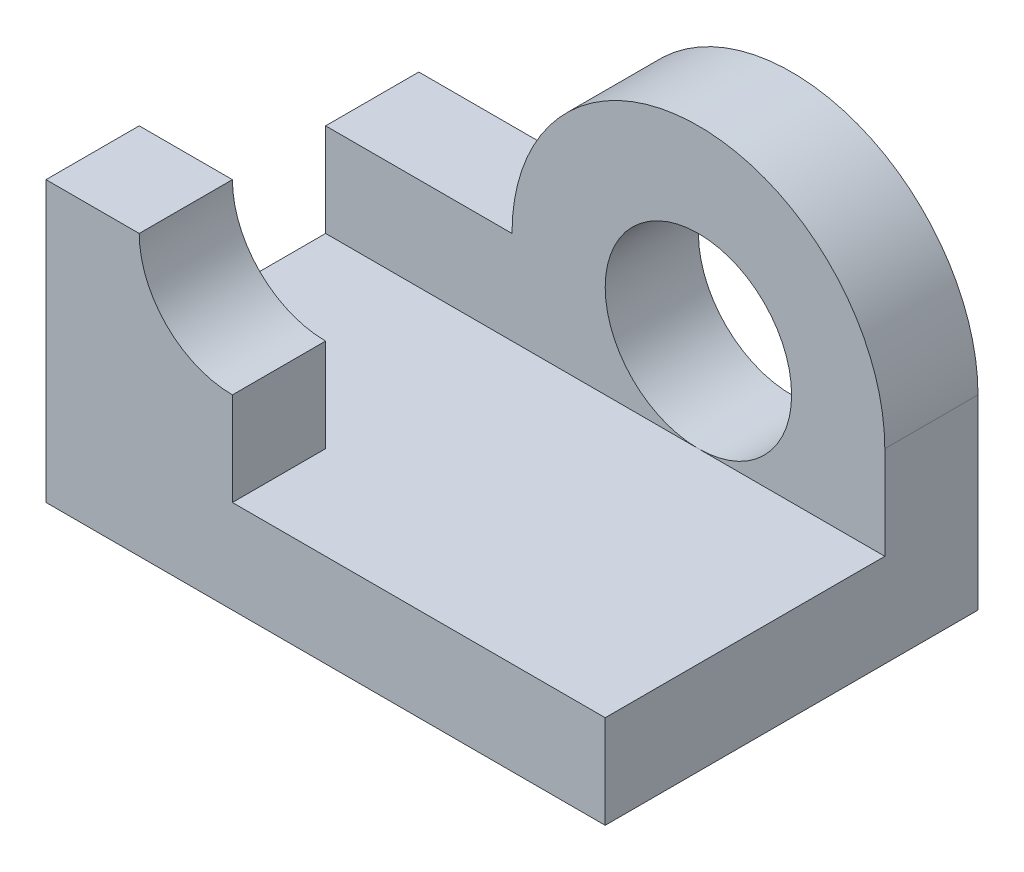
ISO-10303-21;
HEADER;
FILE_DESCRIPTION(('STEP AP214'),'2;1');
FILE_NAME('part.step','',(''),(''),'','','');
FILE_SCHEMA(('AUTOMOTIVE_DESIGN { 1 0 10303 214 1 1 1 1 }'));
ENDSEC;
DATA;
#1=APPLICATION_CONTEXT('core data for automotive mechanical design processes');
#2=APPLICATION_PROTOCOL_DEFINITION('international standard','automotive_design',2000,#1);
#3=PRODUCT_CONTEXT('',#1,'mechanical');
#4=PRODUCT('Part','Part','',(#3));
#5=PRODUCT_RELATED_PRODUCT_CATEGORY('part','',(#4));
#6=PRODUCT_DEFINITION_FORMATION('','',#4);
#7=PRODUCT_DEFINITION_CONTEXT('part definition',#1,'design');
#8=PRODUCT_DEFINITION('design','',#6,#7);
#9=PRODUCT_DEFINITION_SHAPE('','',#8);
#10=(LENGTH_UNIT() NAMED_UNIT(*) SI_UNIT(.MILLI.,.METRE.));
#11=(NAMED_UNIT(*) PLANE_ANGLE_UNIT() SI_UNIT($,.RADIAN.));
#12=(NAMED_UNIT(*) SI_UNIT($,.STERADIAN.) SOLID_ANGLE_UNIT());
#13=UNCERTAINTY_MEASURE_WITH_UNIT(LENGTH_MEASURE(1.E-05),#10,'distance_accuracy_value','');
#14=(GEOMETRIC_REPRESENTATION_CONTEXT(3) GLOBAL_UNCERTAINTY_ASSIGNED_CONTEXT((#13)) GLOBAL_UNIT_ASSIGNED_CONTEXT((#10,
#11,#12)) REPRESENTATION_CONTEXT('',''));
#15=CARTESIAN_POINT('',(0.,0.,0.));
#16=DIRECTION('',(0.,0.,1.));
#17=DIRECTION('',(1.,0.,0.));
#18=AXIS2_PLACEMENT_3D('',#15,#16,#17);
#19=CARTESIAN_POINT('',(0.,10.,-40.));
#20=DIRECTION('',(0.,-1.,0.));
#21=DIRECTION('',(0.,0.,-1.));
#22=AXIS2_PLACEMENT_3D('',#19,#20,#21);
#23=PLANE('',#22);
#24=DIRECTION('',(1.,0.,0.));
#25=VECTOR('',#24,1.);
#26=CARTESIAN_POINT('',(0.,10.,-30.));
#27=LINE('',#26,#25);
#28=CARTESIAN_POINT('',(0.,10.,-30.));
#29=VERTEX_POINT('',#28);
#30=CARTESIAN_POINT('',(40.,10.,-30.));
#31=VERTEX_POINT('',#30);
#32=EDGE_CURVE('E156',#29,#31,#27,.T.);
#33=ORIENTED_EDGE('',*,*,#32,.F.);
#34=DIRECTION('',(0.,0.,1.));
#35=VECTOR('',#34,1.);
#36=CARTESIAN_POINT('',(0.,10.,0.));
#37=LINE('',#36,#35);
#38=CARTESIAN_POINT('',(0.,10.,-10.));
#39=VERTEX_POINT('',#38);
#40=EDGE_CURVE('E34',#29,#39,#37,.T.);
#41=ORIENTED_EDGE('',*,*,#40,.T.);
#42=DIRECTION('',(1.,0.,0.));
#43=VECTOR('',#42,1.);
#44=CARTESIAN_POINT('',(0.,10.,-10.));
#45=LINE('',#44,#43);
#46=CARTESIAN_POINT('',(20.,10.,-10.));
#47=VERTEX_POINT('',#46);
#48=EDGE_CURVE('E161',#39,#47,#45,.T.);
#49=ORIENTED_EDGE('',*,*,#48,.T.);
#50=DIRECTION('',(0.,0.,1.));
#51=VECTOR('',#50,1.);
#52=CARTESIAN_POINT('',(20.,10.,-10.));
#53=LINE('',#52,#51);
#54=CARTESIAN_POINT('',(20.,10.,0.));
#55=VERTEX_POINT('',#54);
#56=EDGE_CURVE('E179',#47,#55,#53,.T.);
#57=ORIENTED_EDGE('',*,*,#56,.T.);
#58=DIRECTION('',(1.,0.,0.));
#59=VECTOR('',#58,1.);
#60=CARTESIAN_POINT('',(0.,10.,0.));
#61=LINE('',#60,#59);
#62=CARTESIAN_POINT('',(60.,10.,0.));
#63=VERTEX_POINT('',#62);
#64=EDGE_CURVE('E208',#55,#63,#61,.T.);
#65=ORIENTED_EDGE('',*,*,#64,.T.);
#66=DIRECTION('',(0.,0.,-1.));
#67=VECTOR('',#66,1.);
#68=CARTESIAN_POINT('',(60.,10.,0.));
#69=LINE('',#68,#67);
#70=CARTESIAN_POINT('',(60.,10.,-30.));
#71=VERTEX_POINT('',#70);
#72=EDGE_CURVE('E52',#63,#71,#69,.T.);
#73=ORIENTED_EDGE('',*,*,#72,.T.);
#74=EDGE_CURVE('E47',#31,#71,#27,.T.);
#75=ORIENTED_EDGE('',*,*,#74,.F.);
#76=EDGE_LOOP('',(#33,#41,#49,#57,#65,#73,#75));
#77=FACE_BOUND('',#76,.T.);
#78=ADVANCED_FACE('F30',(#77),#23,.F.);
#79=CARTESIAN_POINT('',(0.,10.,0.));
#80=DIRECTION('',(1.,0.,0.));
#81=DIRECTION('',(0.,0.,-1.));
#82=AXIS2_PLACEMENT_3D('',#79,#80,#81);
#83=PLANE('',#82);
#84=DIRECTION('',(0.,0.,1.));
#85=VECTOR('',#84,1.);
#86=CARTESIAN_POINT('',(0.,0.,0.));
#87=LINE('',#86,#85);
#88=CARTESIAN_POINT('',(0.,0.,-40.));
#89=VERTEX_POINT('',#88);
#90=CARTESIAN_POINT('',(0.,0.,0.));
#91=VERTEX_POINT('',#90);
#92=EDGE_CURVE('E172',#89,#91,#87,.T.);
#93=ORIENTED_EDGE('',*,*,#92,.T.);
#94=DIRECTION('',(0.,-1.,0.));
#95=VECTOR('',#94,1.);
#96=CARTESIAN_POINT('',(0.,10.,0.));
#97=LINE('',#96,#95);
#98=CARTESIAN_POINT('',(0.,30.,0.));
#99=VERTEX_POINT('',#98);
#100=EDGE_CURVE('E196',#99,#91,#97,.T.);
#101=ORIENTED_EDGE('',*,*,#100,.F.);
#102=DIRECTION('',(0.,0.,1.));
#103=VECTOR('',#102,1.);
#104=CARTESIAN_POINT('',(0.,30.,-10.));
#105=LINE('',#104,#103);
#106=CARTESIAN_POINT('',(0.,30.,-10.));
#107=VERTEX_POINT('',#106);
#108=EDGE_CURVE('E169',#107,#99,#105,.T.);
#109=ORIENTED_EDGE('',*,*,#108,.F.);
#110=DIRECTION('',(0.,-1.,0.));
#111=VECTOR('',#110,1.);
#112=CARTESIAN_POINT('',(0.,10.,-10.));
#113=LINE('',#112,#111);
#114=EDGE_CURVE('E164',#107,#39,#113,.T.);
#115=ORIENTED_EDGE('',*,*,#114,.T.);
#116=ORIENTED_EDGE('',*,*,#40,.F.);
#117=DIRECTION('',(0.,1.,0.));
#118=VECTOR('',#117,1.);
#119=CARTESIAN_POINT('',(0.,0.,-30.));
#120=LINE('',#119,#118);
#121=CARTESIAN_POINT('',(0.,20.,-30.));
#122=VERTEX_POINT('',#121);
#123=EDGE_CURVE('E116',#29,#122,#120,.T.);
#124=ORIENTED_EDGE('',*,*,#123,.T.);
#125=DIRECTION('',(0.,0.,-1.));
#126=VECTOR('',#125,1.);
#127=CARTESIAN_POINT('',(0.,20.,-30.));
#128=LINE('',#127,#126);
#129=CARTESIAN_POINT('',(0.,20.,-40.));
#130=VERTEX_POINT('',#129);
#131=EDGE_CURVE('E120',#122,#130,#128,.T.);
#132=ORIENTED_EDGE('',*,*,#131,.T.);
#133=DIRECTION('',(0.,-1.,0.));
#134=VECTOR('',#133,1.);
#135=CARTESIAN_POINT('',(0.,10.,-40.));
#136=LINE('',#135,#134);
#137=EDGE_CURVE('E212',#130,#89,#136,.T.);
#138=ORIENTED_EDGE('',*,*,#137,.T.);
#139=EDGE_LOOP('',(#93,#101,#109,#115,#116,#124,#132,#138));
#140=FACE_BOUND('',#139,.T.);
#141=ADVANCED_FACE('F118',(#140),#83,.F.);
#142=CARTESIAN_POINT('',(0.,10.,0.));
#143=DIRECTION('',(0.,0.,-1.));
#144=DIRECTION('',(-1.,0.,0.));
#145=AXIS2_PLACEMENT_3D('',#142,#143,#144);
#146=PLANE('',#145);
#147=DIRECTION('',(1.,0.,0.));
#148=VECTOR('',#147,1.);
#149=CARTESIAN_POINT('',(0.,0.,0.));
#150=LINE('',#149,#148);
#151=CARTESIAN_POINT('',(60.,0.,0.));
#152=VERTEX_POINT('',#151);
#153=EDGE_CURVE('E214',#91,#152,#150,.T.);
#154=ORIENTED_EDGE('',*,*,#153,.T.);
#155=DIRECTION('',(0.,-1.,0.));
#156=VECTOR('',#155,1.);
#157=CARTESIAN_POINT('',(60.,10.,0.));
#158=LINE('',#157,#156);
#159=EDGE_CURVE('E201',#63,#152,#158,.T.);
#160=ORIENTED_EDGE('',*,*,#159,.F.);
#161=ORIENTED_EDGE('',*,*,#64,.F.);
#162=DIRECTION('',(0.,1.,0.));
#163=VECTOR('',#162,1.);
#164=CARTESIAN_POINT('',(20.,20.,0.));
#165=LINE('',#164,#163);
#166=CARTESIAN_POINT('',(20.,20.,0.));
#167=VERTEX_POINT('',#166);
#168=EDGE_CURVE('E168',#55,#167,#165,.T.);
#169=ORIENTED_EDGE('',*,*,#168,.T.);
#170=CARTESIAN_POINT('',(20.,30.,0.));
#171=DIRECTION('',(0.,0.,-1.));
#172=DIRECTION('',(-1.,0.,0.));
#173=AXIS2_PLACEMENT_3D('',#170,#171,#172);
#174=CIRCLE('',#173,10.);
#175=CARTESIAN_POINT('',(10.,30.,0.));
#176=VERTEX_POINT('',#175);
#177=EDGE_CURVE('E40',#167,#176,#174,.T.);
#178=ORIENTED_EDGE('',*,*,#177,.T.);
#179=DIRECTION('',(-1.,0.,0.));
#180=VECTOR('',#179,1.);
#181=CARTESIAN_POINT('',(0.,30.,0.));
#182=LINE('',#181,#180);
#183=EDGE_CURVE('E165',#176,#99,#182,.T.);
#184=ORIENTED_EDGE('',*,*,#183,.T.);
#185=ORIENTED_EDGE('',*,*,#100,.T.);
#186=EDGE_LOOP('',(#154,#160,#161,#169,#178,#184,#185));
#187=FACE_BOUND('',#186,.T.);
#188=ADVANCED_FACE('F235',(#187),#146,.F.);
#189=CARTESIAN_POINT('',(60.,10.,0.));
#190=DIRECTION('',(-1.,0.,0.));
#191=DIRECTION('',(0.,0.,1.));
#192=AXIS2_PLACEMENT_3D('',#189,#190,#191);
#193=PLANE('',#192);
#194=DIRECTION('',(0.,-1.,0.));
#195=VECTOR('',#194,1.);
#196=CARTESIAN_POINT('',(60.,10.,-40.));
#197=LINE('',#196,#195);
#198=CARTESIAN_POINT('',(60.,20.,-40.));
#199=VERTEX_POINT('',#198);
#200=CARTESIAN_POINT('',(60.,0.,-40.));
#201=VERTEX_POINT('',#200);
#202=EDGE_CURVE('E204',#199,#201,#197,.T.);
#203=ORIENTED_EDGE('',*,*,#202,.F.);
#204=DIRECTION('',(0.,0.,-1.));
#205=VECTOR('',#204,1.);
#206=CARTESIAN_POINT('',(60.,20.,-30.));
#207=LINE('',#206,#205);
#208=CARTESIAN_POINT('',(60.,20.,-30.));
#209=VERTEX_POINT('',#208);
#210=EDGE_CURVE('E151',#209,#199,#207,.T.);
#211=ORIENTED_EDGE('',*,*,#210,.F.);
#212=DIRECTION('',(0.,-1.,0.));
#213=VECTOR('',#212,1.);
#214=CARTESIAN_POINT('',(60.,20.,-30.));
#215=LINE('',#214,#213);
#216=EDGE_CURVE('E134',#209,#71,#215,.T.);
#217=ORIENTED_EDGE('',*,*,#216,.T.);
#218=ORIENTED_EDGE('',*,*,#72,.F.);
#219=ORIENTED_EDGE('',*,*,#159,.T.);
#220=DIRECTION('',(0.,0.,-1.));
#221=VECTOR('',#220,1.);
#222=CARTESIAN_POINT('',(60.,0.,0.));
#223=LINE('',#222,#221);
#224=EDGE_CURVE('E216',#152,#201,#223,.T.);
#225=ORIENTED_EDGE('',*,*,#224,.T.);
#226=EDGE_LOOP('',(#203,#211,#217,#218,#219,#225));
#227=FACE_BOUND('',#226,.T.);
#228=ADVANCED_FACE('F238',(#227),#193,.F.);
#229=CARTESIAN_POINT('',(0.,10.,-40.));
#230=DIRECTION('',(0.,0.,1.));
#231=DIRECTION('',(1.,0.,0.));
#232=AXIS2_PLACEMENT_3D('',#229,#230,#231);
#233=PLANE('',#232);
#234=CARTESIAN_POINT('',(40.,20.,-40.));
#235=DIRECTION('',(0.,0.,-1.));
#236=DIRECTION('',(-1.,0.,0.));
#237=AXIS2_PLACEMENT_3D('',#234,#235,#236);
#238=CIRCLE('',#237,10.);
#239=CARTESIAN_POINT('',(30.,20.,-40.));
#240=VERTEX_POINT('',#239);
#241=EDGE_CURVE('E261',#240,#240,#238,.T.);
#242=ORIENTED_EDGE('',*,*,#241,.F.);
#243=EDGE_LOOP('',(#242));
#244=FACE_BOUND('',#243,.T.);
#245=DIRECTION('',(-1.,0.,0.));
#246=VECTOR('',#245,1.);
#247=CARTESIAN_POINT('',(0.,0.,-40.));
#248=LINE('',#247,#246);
#249=EDGE_CURVE('E218',#201,#89,#248,.T.);
#250=ORIENTED_EDGE('',*,*,#249,.T.);
#251=ORIENTED_EDGE('',*,*,#137,.F.);
#252=DIRECTION('',(1.,0.,0.));
#253=VECTOR('',#252,1.);
#254=CARTESIAN_POINT('',(0.,20.,-40.));
#255=LINE('',#254,#253);
#256=CARTESIAN_POINT('',(20.,20.,-40.));
#257=VERTEX_POINT('',#256);
#258=EDGE_CURVE('E132',#130,#257,#255,.T.);
#259=ORIENTED_EDGE('',*,*,#258,.T.);
#260=CARTESIAN_POINT('',(40.,20.,-40.));
#261=DIRECTION('',(0.,0.,-1.));
#262=DIRECTION('',(-1.,0.,0.));
#263=AXIS2_PLACEMENT_3D('',#260,#261,#262);
#264=CIRCLE('',#263,20.);
#265=EDGE_CURVE('E126',#257,#199,#264,.T.);
#266=ORIENTED_EDGE('',*,*,#265,.T.);
#267=ORIENTED_EDGE('',*,*,#202,.T.);
#268=EDGE_LOOP('',(#250,#251,#259,#266,#267));
#269=FACE_BOUND('',#268,.T.);
#270=ADVANCED_FACE('F223',(#244,#269),#233,.F.);
#271=CARTESIAN_POINT('',(0.,0.,-40.));
#272=DIRECTION('',(0.,-1.,0.));
#273=DIRECTION('',(0.,0.,-1.));
#274=AXIS2_PLACEMENT_3D('',#271,#272,#273);
#275=PLANE('',#274);
#276=ORIENTED_EDGE('',*,*,#249,.F.);
#277=ORIENTED_EDGE('',*,*,#224,.F.);
#278=ORIENTED_EDGE('',*,*,#153,.F.);
#279=ORIENTED_EDGE('',*,*,#92,.F.);
#280=EDGE_LOOP('',(#276,#277,#278,#279));
#281=FACE_BOUND('',#280,.T.);
#282=ADVANCED_FACE('F229',(#281),#275,.T.);
#283=CARTESIAN_POINT('',(0.,30.,-10.));
#284=DIRECTION('',(0.,1.,0.));
#285=DIRECTION('',(0.,0.,1.));
#286=AXIS2_PLACEMENT_3D('',#283,#284,#285);
#287=PLANE('',#286);
#288=ORIENTED_EDGE('',*,*,#183,.F.);
#289=DIRECTION('',(0.,0.,1.));
#290=VECTOR('',#289,1.);
#291=CARTESIAN_POINT('',(10.,30.,-10.));
#292=LINE('',#291,#290);
#293=CARTESIAN_POINT('',(10.,30.,-10.));
#294=VERTEX_POINT('',#293);
#295=EDGE_CURVE('E173',#294,#176,#292,.T.);
#296=ORIENTED_EDGE('',*,*,#295,.F.);
#297=DIRECTION('',(-1.,0.,0.));
#298=VECTOR('',#297,1.);
#299=CARTESIAN_POINT('',(0.,30.,-10.));
#300=LINE('',#299,#298);
#301=EDGE_CURVE('E160',#294,#107,#300,.T.);
#302=ORIENTED_EDGE('',*,*,#301,.T.);
#303=ORIENTED_EDGE('',*,*,#108,.T.);
#304=EDGE_LOOP('',(#288,#296,#302,#303));
#305=FACE_BOUND('',#304,.T.);
#306=ADVANCED_FACE('F232',(#305),#287,.T.);
#307=CARTESIAN_POINT('',(20.,20.,-10.));
#308=DIRECTION('',(1.,0.,0.));
#309=DIRECTION('',(0.,0.,-1.));
#310=AXIS2_PLACEMENT_3D('',#307,#308,#309);
#311=PLANE('',#310);
#312=ORIENTED_EDGE('',*,*,#168,.F.);
#313=ORIENTED_EDGE('',*,*,#56,.F.);
#314=DIRECTION('',(0.,1.,0.));
#315=VECTOR('',#314,1.);
#316=CARTESIAN_POINT('',(20.,20.,-10.));
#317=LINE('',#316,#315);
#318=CARTESIAN_POINT('',(20.,20.,-10.));
#319=VERTEX_POINT('',#318);
#320=EDGE_CURVE('E157',#47,#319,#317,.T.);
#321=ORIENTED_EDGE('',*,*,#320,.T.);
#322=DIRECTION('',(0.,0.,1.));
#323=VECTOR('',#322,1.);
#324=CARTESIAN_POINT('',(20.,20.,-10.));
#325=LINE('',#324,#323);
#326=EDGE_CURVE('E176',#319,#167,#325,.T.);
#327=ORIENTED_EDGE('',*,*,#326,.T.);
#328=EDGE_LOOP('',(#312,#313,#321,#327));
#329=FACE_BOUND('',#328,.T.);
#330=ADVANCED_FACE('F251',(#329),#311,.T.);
#331=CARTESIAN_POINT('',(20.,10.,-10.));
#332=DIRECTION('',(0.,0.,-1.));
#333=DIRECTION('',(-1.,0.,0.));
#334=AXIS2_PLACEMENT_3D('',#331,#332,#333);
#335=PLANE('',#334);
#336=ORIENTED_EDGE('',*,*,#48,.F.);
#337=ORIENTED_EDGE('',*,*,#114,.F.);
#338=ORIENTED_EDGE('',*,*,#301,.F.);
#339=CARTESIAN_POINT('',(20.,30.,-10.));
#340=DIRECTION('',(0.,0.,-1.));
#341=DIRECTION('',(-1.,0.,0.));
#342=AXIS2_PLACEMENT_3D('',#339,#340,#341);
#343=CIRCLE('',#342,10.);
#344=EDGE_CURVE('E11',#294,#319,#343,.F.);
#345=ORIENTED_EDGE('',*,*,#344,.T.);
#346=ORIENTED_EDGE('',*,*,#320,.F.);
#347=EDGE_LOOP('',(#336,#337,#338,#345,#346));
#348=FACE_BOUND('',#347,.T.);
#349=ADVANCED_FACE('F281',(#348),#335,.T.);
#350=CARTESIAN_POINT('',(20.,30.,-10.));
#351=DIRECTION('',(0.,0.,-1.));
#352=DIRECTION('',(-1.,0.,0.));
#353=AXIS2_PLACEMENT_3D('',#350,#351,#352);
#354=CYLINDRICAL_SURFACE('',#353,10.);
#355=ORIENTED_EDGE('',*,*,#344,.F.);
#356=ORIENTED_EDGE('',*,*,#295,.T.);
#357=ORIENTED_EDGE('',*,*,#177,.F.);
#358=ORIENTED_EDGE('',*,*,#326,.F.);
#359=EDGE_LOOP('',(#355,#356,#357,#358));
#360=FACE_BOUND('',#359,.T.);
#361=ADVANCED_FACE('F32',(#360),#354,.F.);
#362=CARTESIAN_POINT('',(40.,20.,-30.));
#363=DIRECTION('',(0.,0.,-1.));
#364=DIRECTION('',(-1.,0.,0.));
#365=AXIS2_PLACEMENT_3D('',#362,#363,#364);
#366=PLANE('',#365);
#367=ORIENTED_EDGE('',*,*,#123,.F.);
#368=ORIENTED_EDGE('',*,*,#32,.T.);
#369=CARTESIAN_POINT('',(40.,20.,-30.));
#370=DIRECTION('',(0.,0.,-1.));
#371=DIRECTION('',(-1.,0.,0.));
#372=AXIS2_PLACEMENT_3D('',#369,#370,#371);
#373=CIRCLE('',#372,10.);
#374=EDGE_CURVE('E148',#31,#31,#373,.T.);
#375=ORIENTED_EDGE('',*,*,#374,.T.);
#376=ORIENTED_EDGE('',*,*,#74,.T.);
#377=ORIENTED_EDGE('',*,*,#216,.F.);
#378=CARTESIAN_POINT('',(40.,20.,-30.));
#379=DIRECTION('',(0.,0.,-1.));
#380=DIRECTION('',(-1.,0.,0.));
#381=AXIS2_PLACEMENT_3D('',#378,#379,#380);
#382=CIRCLE('',#381,20.);
#383=CARTESIAN_POINT('',(20.,20.,-30.));
#384=VERTEX_POINT('',#383);
#385=EDGE_CURVE('E140',#384,#209,#382,.T.);
#386=ORIENTED_EDGE('',*,*,#385,.F.);
#387=DIRECTION('',(1.,0.,0.));
#388=VECTOR('',#387,1.);
#389=CARTESIAN_POINT('',(0.,20.,-30.));
#390=LINE('',#389,#388);
#391=EDGE_CURVE('E125',#122,#384,#390,.T.);
#392=ORIENTED_EDGE('',*,*,#391,.F.);
#393=EDGE_LOOP('',(#367,#368,#375,#376,#377,#386,#392));
#394=FACE_BOUND('',#393,.T.);
#395=ADVANCED_FACE('F137',(#394),#366,.F.);
#396=CARTESIAN_POINT('',(40.,20.,-30.));
#397=DIRECTION('',(0.,0.,-1.));
#398=DIRECTION('',(-1.,0.,0.));
#399=AXIS2_PLACEMENT_3D('',#396,#397,#398);
#400=CYLINDRICAL_SURFACE('',#399,20.);
#401=ORIENTED_EDGE('',*,*,#265,.F.);
#402=DIRECTION('',(0.,0.,-1.));
#403=VECTOR('',#402,1.);
#404=CARTESIAN_POINT('',(20.,20.,-30.));
#405=LINE('',#404,#403);
#406=EDGE_CURVE('E133',#384,#257,#405,.T.);
#407=ORIENTED_EDGE('',*,*,#406,.F.);
#408=ORIENTED_EDGE('',*,*,#385,.T.);
#409=ORIENTED_EDGE('',*,*,#210,.T.);
#410=EDGE_LOOP('',(#401,#407,#408,#409));
#411=FACE_BOUND('',#410,.T.);
#412=ADVANCED_FACE('F273',(#411),#400,.T.);
#413=CARTESIAN_POINT('',(0.,20.,-30.));
#414=DIRECTION('',(0.,1.,0.));
#415=DIRECTION('',(0.,0.,1.));
#416=AXIS2_PLACEMENT_3D('',#413,#414,#415);
#417=PLANE('',#416);
#418=ORIENTED_EDGE('',*,*,#258,.F.);
#419=ORIENTED_EDGE('',*,*,#131,.F.);
#420=ORIENTED_EDGE('',*,*,#391,.T.);
#421=ORIENTED_EDGE('',*,*,#406,.T.);
#422=EDGE_LOOP('',(#418,#419,#420,#421));
#423=FACE_BOUND('',#422,.T.);
#424=ADVANCED_FACE('F130',(#423),#417,.T.);
#425=CARTESIAN_POINT('',(40.,20.,-30.));
#426=DIRECTION('',(0.,0.,-1.));
#427=DIRECTION('',(-1.,0.,0.));
#428=AXIS2_PLACEMENT_3D('',#425,#426,#427);
#429=CYLINDRICAL_SURFACE('',#428,10.);
#430=ORIENTED_EDGE('',*,*,#241,.T.);
#431=EDGE_LOOP('',(#430));
#432=FACE_BOUND('',#431,.T.);
#433=ORIENTED_EDGE('',*,*,#374,.F.);
#434=EDGE_LOOP('',(#433));
#435=FACE_BOUND('',#434,.T.);
#436=ADVANCED_FACE('F267',(#432,#435),#429,.F.);
#437=CLOSED_SHELL('',(#78,#141,#188,#228,#270,#282,#306,#330,#349,#361,#395,#412,#424,#436));
#438=MANIFOLD_SOLID_BREP('B2',#437);
#439=ADVANCED_BREP_SHAPE_REPRESENTATION('',(#18,#438),#14);
#440=SHAPE_DEFINITION_REPRESENTATION(#9,#439);
ENDSEC;
END-ISO-10303-21;
